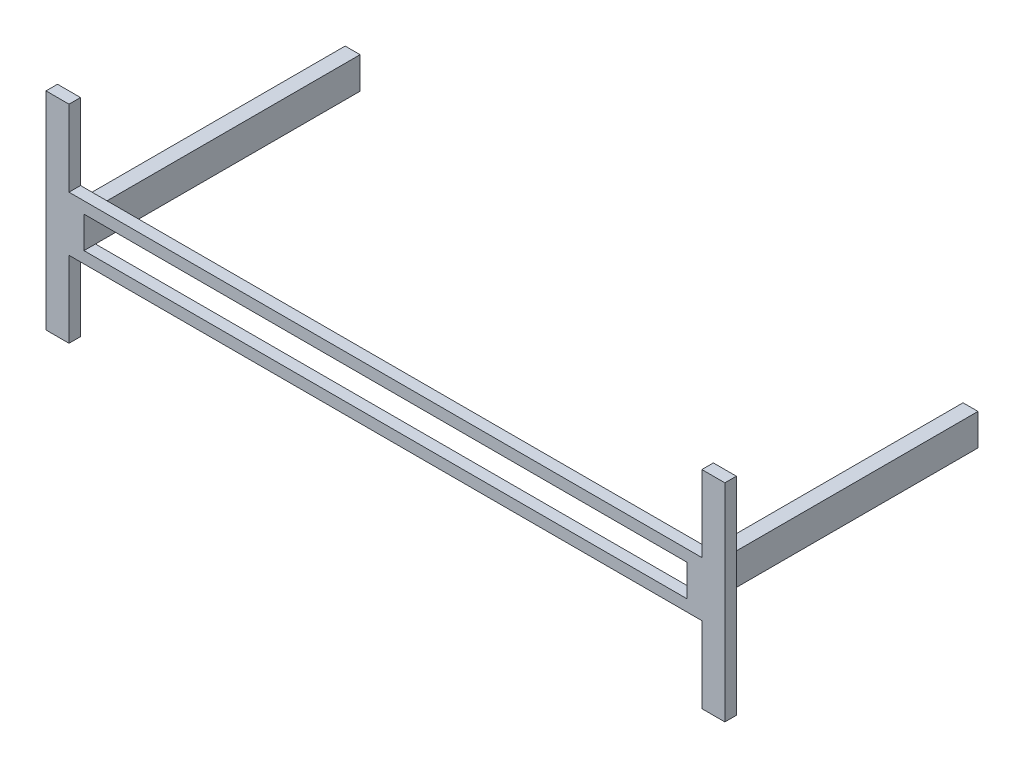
ISO-10303-21;
HEADER;
FILE_DESCRIPTION(('STEP AP214'),'2;1');
FILE_NAME('part.step','',(''),(''),'','','');
FILE_SCHEMA(('AUTOMOTIVE_DESIGN { 1 0 10303 214 1 1 1 1 }'));
ENDSEC;
DATA;
#1=APPLICATION_CONTEXT('core data for automotive mechanical design processes');
#2=APPLICATION_PROTOCOL_DEFINITION('international standard','automotive_design',2000,#1);
#3=PRODUCT_CONTEXT('',#1,'mechanical');
#4=PRODUCT('Part','Part','',(#3));
#5=PRODUCT_RELATED_PRODUCT_CATEGORY('part','',(#4));
#6=PRODUCT_DEFINITION_FORMATION('','',#4);
#7=PRODUCT_DEFINITION_CONTEXT('part definition',#1,'design');
#8=PRODUCT_DEFINITION('design','',#6,#7);
#9=PRODUCT_DEFINITION_SHAPE('','',#8);
#10=(LENGTH_UNIT() NAMED_UNIT(*) SI_UNIT(.MILLI.,.METRE.));
#11=(NAMED_UNIT(*) PLANE_ANGLE_UNIT() SI_UNIT($,.RADIAN.));
#12=(NAMED_UNIT(*) SI_UNIT($,.STERADIAN.) SOLID_ANGLE_UNIT());
#13=UNCERTAINTY_MEASURE_WITH_UNIT(LENGTH_MEASURE(1.E-05),#10,'distance_accuracy_value','');
#14=(GEOMETRIC_REPRESENTATION_CONTEXT(3) GLOBAL_UNCERTAINTY_ASSIGNED_CONTEXT((#13)) GLOBAL_UNIT_ASSIGNED_CONTEXT((#10,
#11,#12)) REPRESENTATION_CONTEXT('',''));
#15=CARTESIAN_POINT('',(0.,0.,0.));
#16=DIRECTION('',(0.,0.,1.));
#17=DIRECTION('',(1.,0.,0.));
#18=AXIS2_PLACEMENT_3D('',#15,#16,#17);
#19=CARTESIAN_POINT('',(0.,-34.9249999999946,-609.6));
#20=DIRECTION('',(0.,-1.,0.));
#21=DIRECTION('',(0.,0.,-1.));
#22=AXIS2_PLACEMENT_3D('',#19,#20,#21);
#23=PLANE('',#22);
#24=DIRECTION('',(0.,0.,1.));
#25=VECTOR('',#24,1.);
#26=CARTESIAN_POINT('',(-665.48,-34.9249999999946,-609.6));
#27=LINE('',#26,#25);
#28=CARTESIAN_POINT('',(-665.48,-34.9249999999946,-609.6));
#29=VERTEX_POINT('',#28);
#30=CARTESIAN_POINT('',(-665.48,-34.9249999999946,-25.4));
#31=VERTEX_POINT('',#30);
#32=EDGE_CURVE('E12',#29,#31,#27,.T.);
#33=ORIENTED_EDGE('',*,*,#32,.T.);
#34=DIRECTION('',(1.,0.,0.));
#35=VECTOR('',#34,1.);
#36=CARTESIAN_POINT('',(0.,-34.9249999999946,-25.4));
#37=LINE('',#36,#35);
#38=CARTESIAN_POINT('',(-698.5,-34.9249999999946,-25.4));
#39=VERTEX_POINT('',#38);
#40=EDGE_CURVE('E315',#39,#31,#37,.T.);
#41=ORIENTED_EDGE('',*,*,#40,.F.);
#42=DIRECTION('',(0.,0.,1.));
#43=VECTOR('',#42,1.);
#44=CARTESIAN_POINT('',(-698.499999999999,-34.9249999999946,-609.6));
#45=LINE('',#44,#43);
#46=CARTESIAN_POINT('',(-698.499999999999,-34.9249999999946,-609.6));
#47=VERTEX_POINT('',#46);
#48=EDGE_CURVE('E100',#47,#39,#45,.T.);
#49=ORIENTED_EDGE('',*,*,#48,.F.);
#50=DIRECTION('',(1.,0.,0.));
#51=VECTOR('',#50,1.);
#52=CARTESIAN_POINT('',(0.,-34.9249999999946,-609.6));
#53=LINE('',#52,#51);
#54=EDGE_CURVE('E450',#47,#29,#53,.T.);
#55=ORIENTED_EDGE('',*,*,#54,.T.);
#56=EDGE_LOOP('',(#33,#41,#49,#55));
#57=FACE_BOUND('',#56,.T.);
#58=ADVANCED_FACE('F89',(#57),#23,.T.);
#59=CARTESIAN_POINT('',(-698.5,-8.88178419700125E-12,-609.6));
#60=DIRECTION('',(-1.,0.,0.));
#61=DIRECTION('',(0.,-1.,0.));
#62=AXIS2_PLACEMENT_3D('',#59,#60,#61);
#63=PLANE('',#62);
#64=ORIENTED_EDGE('',*,*,#48,.T.);
#65=DIRECTION('',(0.,-1.,0.));
#66=VECTOR('',#65,1.);
#67=CARTESIAN_POINT('',(-698.5,0.,-25.4));
#68=LINE('',#67,#66);
#69=CARTESIAN_POINT('',(-698.5,34.9250000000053,-25.4));
#70=VERTEX_POINT('',#69);
#71=EDGE_CURVE('E310',#70,#39,#68,.T.);
#72=ORIENTED_EDGE('',*,*,#71,.F.);
#73=DIRECTION('',(0.,0.,1.));
#74=VECTOR('',#73,1.);
#75=CARTESIAN_POINT('',(-698.5,34.9250000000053,-609.6));
#76=LINE('',#75,#74);
#77=CARTESIAN_POINT('',(-698.5,34.9250000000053,-609.6));
#78=VERTEX_POINT('',#77);
#79=EDGE_CURVE('E459',#78,#70,#76,.T.);
#80=ORIENTED_EDGE('',*,*,#79,.F.);
#81=DIRECTION('',(0.,-1.,0.));
#82=VECTOR('',#81,1.);
#83=CARTESIAN_POINT('',(-698.5,-8.88178419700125E-12,-609.6));
#84=LINE('',#83,#82);
#85=EDGE_CURVE('E446',#78,#47,#84,.T.);
#86=ORIENTED_EDGE('',*,*,#85,.T.);
#87=EDGE_LOOP('',(#64,#72,#80,#86));
#88=FACE_BOUND('',#87,.T.);
#89=ADVANCED_FACE('F478',(#88),#63,.T.);
#90=CARTESIAN_POINT('',(0.,34.9250000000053,-609.6));
#91=DIRECTION('',(0.,-1.,0.));
#92=DIRECTION('',(0.,0.,-1.));
#93=AXIS2_PLACEMENT_3D('',#90,#91,#92);
#94=PLANE('',#93);
#95=DIRECTION('',(1.,0.,0.));
#96=VECTOR('',#95,1.);
#97=CARTESIAN_POINT('',(0.,34.9250000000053,-25.4));
#98=LINE('',#97,#96);
#99=CARTESIAN_POINT('',(-665.48,34.9250000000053,-25.4));
#100=VERTEX_POINT('',#99);
#101=EDGE_CURVE('E319',#70,#100,#98,.T.);
#102=ORIENTED_EDGE('',*,*,#101,.T.);
#103=DIRECTION('',(0.,0.,1.));
#104=VECTOR('',#103,1.);
#105=CARTESIAN_POINT('',(-665.48,34.9250000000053,-609.6));
#106=LINE('',#105,#104);
#107=CARTESIAN_POINT('',(-665.48,34.9250000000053,-609.6));
#108=VERTEX_POINT('',#107);
#109=EDGE_CURVE('E93',#108,#100,#106,.T.);
#110=ORIENTED_EDGE('',*,*,#109,.F.);
#111=DIRECTION('',(1.,0.,0.));
#112=VECTOR('',#111,1.);
#113=CARTESIAN_POINT('',(0.,34.9250000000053,-609.6));
#114=LINE('',#113,#112);
#115=EDGE_CURVE('E443',#78,#108,#114,.T.);
#116=ORIENTED_EDGE('',*,*,#115,.F.);
#117=ORIENTED_EDGE('',*,*,#79,.T.);
#118=EDGE_LOOP('',(#102,#110,#116,#117));
#119=FACE_BOUND('',#118,.T.);
#120=ADVANCED_FACE('F469',(#119),#94,.F.);
#121=CARTESIAN_POINT('',(-665.48,0.,-609.6));
#122=DIRECTION('',(-1.,0.,0.));
#123=DIRECTION('',(0.,0.,1.));
#124=AXIS2_PLACEMENT_3D('',#121,#122,#123);
#125=PLANE('',#124);
#126=DIRECTION('',(0.,-1.,0.));
#127=VECTOR('',#126,1.);
#128=CARTESIAN_POINT('',(-665.48,0.,0.));
#129=LINE('',#128,#127);
#130=CARTESIAN_POINT('',(-665.48,34.9250000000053,0.));
#131=VERTEX_POINT('',#130);
#132=CARTESIAN_POINT('',(-665.48,-34.9249999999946,0.));
#133=VERTEX_POINT('',#132);
#134=EDGE_CURVE('E440',#131,#133,#129,.T.);
#135=ORIENTED_EDGE('',*,*,#134,.T.);
#136=DIRECTION('',(0.,0.,1.));
#137=VECTOR('',#136,1.);
#138=CARTESIAN_POINT('',(-665.48,-34.9249999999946,-609.6));
#139=LINE('',#138,#137);
#140=EDGE_CURVE('E363',#31,#133,#139,.T.);
#141=ORIENTED_EDGE('',*,*,#140,.F.);
#142=ORIENTED_EDGE('',*,*,#32,.F.);
#143=DIRECTION('',(0.,-1.,0.));
#144=VECTOR('',#143,1.);
#145=CARTESIAN_POINT('',(-665.48,0.,-609.6));
#146=LINE('',#145,#144);
#147=EDGE_CURVE('E108',#108,#29,#146,.T.);
#148=ORIENTED_EDGE('',*,*,#147,.F.);
#149=ORIENTED_EDGE('',*,*,#109,.T.);
#150=DIRECTION('',(0.,0.,1.));
#151=VECTOR('',#150,1.);
#152=CARTESIAN_POINT('',(-665.48,34.9250000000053,-609.6));
#153=LINE('',#152,#151);
#154=EDGE_CURVE('E436',#100,#131,#153,.T.);
#155=ORIENTED_EDGE('',*,*,#154,.T.);
#156=EDGE_LOOP('',(#135,#141,#142,#148,#149,#155));
#157=FACE_BOUND('',#156,.T.);
#158=ADVANCED_FACE('F91',(#157),#125,.F.);
#159=CARTESIAN_POINT('',(0.,0.,-609.6));
#160=DIRECTION('',(0.,0.,1.));
#161=DIRECTION('',(1.,0.,0.));
#162=AXIS2_PLACEMENT_3D('',#159,#160,#161);
#163=PLANE('',#162);
#164=ORIENTED_EDGE('',*,*,#147,.T.);
#165=ORIENTED_EDGE('',*,*,#54,.F.);
#166=ORIENTED_EDGE('',*,*,#85,.F.);
#167=ORIENTED_EDGE('',*,*,#115,.T.);
#168=EDGE_LOOP('',(#164,#165,#166,#167));
#169=FACE_BOUND('',#168,.T.);
#170=ADVANCED_FACE('F551',(#169),#163,.F.);
#171=CARTESIAN_POINT('',(0.,0.,0.));
#172=DIRECTION('',(0.,0.,1.));
#173=DIRECTION('',(1.,0.,0.));
#174=AXIS2_PLACEMENT_3D('',#171,#172,#173);
#175=PLANE('',#174);
#176=ORIENTED_EDGE('',*,*,#134,.F.);
#177=DIRECTION('',(1.,0.,0.));
#178=VECTOR('',#177,1.);
#179=CARTESIAN_POINT('',(0.,34.9250000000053,0.));
#180=LINE('',#179,#178);
#181=CARTESIAN_POINT('',(665.48,34.9250000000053,0.));
#182=VERTEX_POINT('',#181);
#183=EDGE_CURVE('E352',#131,#182,#180,.T.);
#184=ORIENTED_EDGE('',*,*,#183,.T.);
#185=DIRECTION('',(0.,-1.,0.));
#186=VECTOR('',#185,1.);
#187=CARTESIAN_POINT('',(665.48,0.,0.));
#188=LINE('',#187,#186);
#189=CARTESIAN_POINT('',(665.48,-34.9249999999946,0.));
#190=VERTEX_POINT('',#189);
#191=EDGE_CURVE('E266',#182,#190,#188,.T.);
#192=ORIENTED_EDGE('',*,*,#191,.T.);
#193=DIRECTION('',(1.,0.,0.));
#194=VECTOR('',#193,1.);
#195=CARTESIAN_POINT('',(0.,-34.9249999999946,0.));
#196=LINE('',#195,#194);
#197=EDGE_CURVE('E348',#133,#190,#196,.T.);
#198=ORIENTED_EDGE('',*,*,#197,.F.);
#199=EDGE_LOOP('',(#176,#184,#192,#198));
#200=FACE_BOUND('',#199,.T.);
#201=DIRECTION('',(1.,0.,0.));
#202=VECTOR('',#201,1.);
#203=CARTESIAN_POINT('',(0.,-60.3249999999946,0.));
#204=LINE('',#203,#202);
#205=CARTESIAN_POINT('',(-698.5,-60.3249999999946,0.));
#206=VERTEX_POINT('',#205);
#207=CARTESIAN_POINT('',(698.5,-60.3249999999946,0.));
#208=VERTEX_POINT('',#207);
#209=EDGE_CURVE('E344',#206,#208,#204,.T.);
#210=ORIENTED_EDGE('',*,*,#209,.T.);
#211=DIRECTION('',(0.,-1.,0.));
#212=VECTOR('',#211,1.);
#213=CARTESIAN_POINT('',(698.5,228.6,0.));
#214=LINE('',#213,#212);
#215=CARTESIAN_POINT('',(698.5,-228.6,0.));
#216=VERTEX_POINT('',#215);
#217=EDGE_CURVE('E417',#208,#216,#214,.T.);
#218=ORIENTED_EDGE('',*,*,#217,.T.);
#219=DIRECTION('',(1.,0.,0.));
#220=VECTOR('',#219,1.);
#221=CARTESIAN_POINT('',(698.5,-228.6,0.));
#222=LINE('',#221,#220);
#223=CARTESIAN_POINT('',(749.3,-228.6,0.));
#224=VERTEX_POINT('',#223);
#225=EDGE_CURVE('E413',#216,#224,#222,.T.);
#226=ORIENTED_EDGE('',*,*,#225,.T.);
#227=DIRECTION('',(0.,-1.,0.));
#228=VECTOR('',#227,1.);
#229=CARTESIAN_POINT('',(749.3,228.6,0.));
#230=LINE('',#229,#228);
#231=CARTESIAN_POINT('',(749.3,228.6,0.));
#232=VERTEX_POINT('',#231);
#233=EDGE_CURVE('E409',#232,#224,#230,.T.);
#234=ORIENTED_EDGE('',*,*,#233,.F.);
#235=DIRECTION('',(1.,0.,0.));
#236=VECTOR('',#235,1.);
#237=CARTESIAN_POINT('',(698.5,228.6,0.));
#238=LINE('',#237,#236);
#239=CARTESIAN_POINT('',(698.5,228.6,0.));
#240=VERTEX_POINT('',#239);
#241=EDGE_CURVE('E292',#240,#232,#238,.T.);
#242=ORIENTED_EDGE('',*,*,#241,.F.);
#243=CARTESIAN_POINT('',(698.5,60.3250000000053,0.));
#244=VERTEX_POINT('',#243);
#245=EDGE_CURVE('E392',#240,#244,#214,.T.);
#246=ORIENTED_EDGE('',*,*,#245,.T.);
#247=DIRECTION('',(1.,0.,0.));
#248=VECTOR('',#247,1.);
#249=CARTESIAN_POINT('',(0.,60.3250000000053,0.));
#250=LINE('',#249,#248);
#251=CARTESIAN_POINT('',(-698.5,60.3250000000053,0.));
#252=VERTEX_POINT('',#251);
#253=EDGE_CURVE('E356',#252,#244,#250,.T.);
#254=ORIENTED_EDGE('',*,*,#253,.F.);
#255=DIRECTION('',(0.,-1.,0.));
#256=VECTOR('',#255,1.);
#257=CARTESIAN_POINT('',(-698.5,0.,0.));
#258=LINE('',#257,#256);
#259=CARTESIAN_POINT('',(-698.5,228.6,0.));
#260=VERTEX_POINT('',#259);
#261=EDGE_CURVE('E298',#260,#252,#258,.T.);
#262=ORIENTED_EDGE('',*,*,#261,.F.);
#263=DIRECTION('',(-1.,0.,0.));
#264=VECTOR('',#263,1.);
#265=CARTESIAN_POINT('',(-2.49800180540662E-13,228.600000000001,0.));
#266=LINE('',#265,#264);
#267=CARTESIAN_POINT('',(-749.3,228.6,0.));
#268=VERTEX_POINT('',#267);
#269=EDGE_CURVE('E328',#260,#268,#266,.T.);
#270=ORIENTED_EDGE('',*,*,#269,.T.);
#271=DIRECTION('',(0.,-1.,0.));
#272=VECTOR('',#271,1.);
#273=CARTESIAN_POINT('',(-749.3,1.81953217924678E-13,0.));
#274=LINE('',#273,#272);
#275=CARTESIAN_POINT('',(-749.3,-228.6,0.));
#276=VERTEX_POINT('',#275);
#277=EDGE_CURVE('E332',#268,#276,#274,.T.);
#278=ORIENTED_EDGE('',*,*,#277,.T.);
#279=DIRECTION('',(-1.,0.,0.));
#280=VECTOR('',#279,1.);
#281=CARTESIAN_POINT('',(-1.49880108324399E-12,-228.600000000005,0.));
#282=LINE('',#281,#280);
#283=CARTESIAN_POINT('',(-698.5,-228.6,0.));
#284=VERTEX_POINT('',#283);
#285=EDGE_CURVE('E337',#284,#276,#282,.T.);
#286=ORIENTED_EDGE('',*,*,#285,.F.);
#287=EDGE_CURVE('E341',#206,#284,#258,.T.);
#288=ORIENTED_EDGE('',*,*,#287,.F.);
#289=EDGE_LOOP('',(#210,#218,#226,#234,#242,#246,#254,#262,#270,#278,#286,#288));
#290=FACE_BOUND('',#289,.T.);
#291=ADVANCED_FACE('F536',(#200,#290),#175,.T.);
#292=CARTESIAN_POINT('',(0.,34.9250000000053,-25.4));
#293=DIRECTION('',(0.,-1.,0.));
#294=DIRECTION('',(0.,0.,-1.));
#295=AXIS2_PLACEMENT_3D('',#292,#293,#294);
#296=PLANE('',#295);
#297=DIRECTION('',(0.,0.,1.));
#298=VECTOR('',#297,1.);
#299=CARTESIAN_POINT('',(665.48,34.9250000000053,-609.6));
#300=LINE('',#299,#298);
#301=CARTESIAN_POINT('',(665.48,34.9250000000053,-25.4000000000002));
#302=VERTEX_POINT('',#301);
#303=EDGE_CURVE('E258',#302,#182,#300,.T.);
#304=ORIENTED_EDGE('',*,*,#303,.T.);
#305=ORIENTED_EDGE('',*,*,#183,.F.);
#306=ORIENTED_EDGE('',*,*,#154,.F.);
#307=EDGE_CURVE('E324',#100,#302,#98,.T.);
#308=ORIENTED_EDGE('',*,*,#307,.T.);
#309=EDGE_LOOP('',(#304,#305,#306,#308));
#310=FACE_BOUND('',#309,.T.);
#311=ADVANCED_FACE('F544',(#310),#296,.T.);
#312=CARTESIAN_POINT('',(0.,-34.9249999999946,-25.4));
#313=DIRECTION('',(0.,-1.,0.));
#314=DIRECTION('',(0.,0.,-1.));
#315=AXIS2_PLACEMENT_3D('',#312,#313,#314);
#316=PLANE('',#315);
#317=ORIENTED_EDGE('',*,*,#197,.T.);
#318=DIRECTION('',(0.,0.,1.));
#319=VECTOR('',#318,1.);
#320=CARTESIAN_POINT('',(665.48,-34.9249999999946,-609.6));
#321=LINE('',#320,#319);
#322=CARTESIAN_POINT('',(665.48,-34.9249999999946,-25.4000000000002));
#323=VERTEX_POINT('',#322);
#324=EDGE_CURVE('E282',#323,#190,#321,.T.);
#325=ORIENTED_EDGE('',*,*,#324,.F.);
#326=EDGE_CURVE('E314',#31,#323,#37,.T.);
#327=ORIENTED_EDGE('',*,*,#326,.F.);
#328=ORIENTED_EDGE('',*,*,#140,.T.);
#329=EDGE_LOOP('',(#317,#325,#327,#328));
#330=FACE_BOUND('',#329,.T.);
#331=ADVANCED_FACE('F593',(#330),#316,.F.);
#332=CARTESIAN_POINT('',(-698.5,0.,-25.4));
#333=DIRECTION('',(-1.,0.,0.));
#334=DIRECTION('',(0.,0.,1.));
#335=AXIS2_PLACEMENT_3D('',#332,#333,#334);
#336=PLANE('',#335);
#337=ORIENTED_EDGE('',*,*,#261,.T.);
#338=DIRECTION('',(0.,0.,1.));
#339=VECTOR('',#338,1.);
#340=CARTESIAN_POINT('',(-698.5,60.3250000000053,-25.4));
#341=LINE('',#340,#339);
#342=CARTESIAN_POINT('',(-698.5,60.3250000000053,-25.4));
#343=VERTEX_POINT('',#342);
#344=EDGE_CURVE('E364',#343,#252,#341,.T.);
#345=ORIENTED_EDGE('',*,*,#344,.F.);
#346=CARTESIAN_POINT('',(-698.5,228.6,-25.4));
#347=VERTEX_POINT('',#346);
#348=EDGE_CURVE('E309',#347,#343,#68,.T.);
#349=ORIENTED_EDGE('',*,*,#348,.F.);
#350=DIRECTION('',(0.,0.,1.));
#351=VECTOR('',#350,1.);
#352=CARTESIAN_POINT('',(-698.5,228.6,-25.4));
#353=LINE('',#352,#351);
#354=EDGE_CURVE('E360',#347,#260,#353,.T.);
#355=ORIENTED_EDGE('',*,*,#354,.T.);
#356=EDGE_LOOP('',(#337,#345,#349,#355));
#357=FACE_BOUND('',#356,.T.);
#358=ADVANCED_FACE('F491',(#357),#336,.F.);
#359=CARTESIAN_POINT('',(0.,60.3250000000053,-25.4));
#360=DIRECTION('',(0.,-1.,0.));
#361=DIRECTION('',(0.,0.,-1.));
#362=AXIS2_PLACEMENT_3D('',#359,#360,#361);
#363=PLANE('',#362);
#364=ORIENTED_EDGE('',*,*,#253,.T.);
#365=DIRECTION('',(0.,0.,1.));
#366=VECTOR('',#365,1.);
#367=CARTESIAN_POINT('',(698.5,60.3250000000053,-25.4));
#368=LINE('',#367,#366);
#369=CARTESIAN_POINT('',(698.5,60.3250000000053,-25.4));
#370=VERTEX_POINT('',#369);
#371=EDGE_CURVE('E368',#370,#244,#368,.T.);
#372=ORIENTED_EDGE('',*,*,#371,.F.);
#373=DIRECTION('',(1.,0.,0.));
#374=VECTOR('',#373,1.);
#375=CARTESIAN_POINT('',(0.,60.3250000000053,-25.4));
#376=LINE('',#375,#374);
#377=EDGE_CURVE('E323',#343,#370,#376,.T.);
#378=ORIENTED_EDGE('',*,*,#377,.F.);
#379=ORIENTED_EDGE('',*,*,#344,.T.);
#380=EDGE_LOOP('',(#364,#372,#378,#379));
#381=FACE_BOUND('',#380,.T.);
#382=ADVANCED_FACE('F495',(#381),#363,.F.);
#383=CARTESIAN_POINT('',(0.,-60.3249999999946,-25.4));
#384=DIRECTION('',(0.,-1.,0.));
#385=DIRECTION('',(0.,0.,-1.));
#386=AXIS2_PLACEMENT_3D('',#383,#384,#385);
#387=PLANE('',#386);
#388=ORIENTED_EDGE('',*,*,#209,.F.);
#389=DIRECTION('',(0.,0.,1.));
#390=VECTOR('',#389,1.);
#391=CARTESIAN_POINT('',(-698.5,-60.3249999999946,-25.4));
#392=LINE('',#391,#390);
#393=CARTESIAN_POINT('',(-698.5,-60.3249999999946,-25.4));
#394=VERTEX_POINT('',#393);
#395=EDGE_CURVE('E374',#394,#206,#392,.T.);
#396=ORIENTED_EDGE('',*,*,#395,.F.);
#397=DIRECTION('',(1.,0.,0.));
#398=VECTOR('',#397,1.);
#399=CARTESIAN_POINT('',(0.,-60.3249999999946,-25.4));
#400=LINE('',#399,#398);
#401=CARTESIAN_POINT('',(698.5,-60.3249999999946,-25.4));
#402=VERTEX_POINT('',#401);
#403=EDGE_CURVE('E308',#394,#402,#400,.T.);
#404=ORIENTED_EDGE('',*,*,#403,.T.);
#405=DIRECTION('',(0.,0.,1.));
#406=VECTOR('',#405,1.);
#407=CARTESIAN_POINT('',(698.5,-60.3249999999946,-25.4));
#408=LINE('',#407,#406);
#409=EDGE_CURVE('E371',#402,#208,#408,.T.);
#410=ORIENTED_EDGE('',*,*,#409,.T.);
#411=EDGE_LOOP('',(#388,#396,#404,#410));
#412=FACE_BOUND('',#411,.T.);
#413=ADVANCED_FACE('F517',(#412),#387,.T.);
#414=ORIENTED_EDGE('',*,*,#287,.T.);
#415=DIRECTION('',(0.,0.,1.));
#416=VECTOR('',#415,1.);
#417=CARTESIAN_POINT('',(-698.5,-228.6,-25.4));
#418=LINE('',#417,#416);
#419=CARTESIAN_POINT('',(-698.5,-228.6,-25.4));
#420=VERTEX_POINT('',#419);
#421=EDGE_CURVE('E377',#420,#284,#418,.T.);
#422=ORIENTED_EDGE('',*,*,#421,.F.);
#423=EDGE_CURVE('E305',#394,#420,#68,.T.);
#424=ORIENTED_EDGE('',*,*,#423,.F.);
#425=ORIENTED_EDGE('',*,*,#395,.T.);
#426=EDGE_LOOP('',(#414,#422,#424,#425));
#427=FACE_BOUND('',#426,.T.);
#428=ADVANCED_FACE('F523',(#427),#336,.F.);
#429=CARTESIAN_POINT('',(-1.49880108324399E-12,-228.600000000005,-25.4));
#430=DIRECTION('',(0.,1.,0.));
#431=DIRECTION('',(-1.,0.,0.));
#432=AXIS2_PLACEMENT_3D('',#429,#430,#431);
#433=PLANE('',#432);
#434=ORIENTED_EDGE('',*,*,#285,.T.);
#435=DIRECTION('',(0.,0.,1.));
#436=VECTOR('',#435,1.);
#437=CARTESIAN_POINT('',(-749.3,-228.6,-25.4));
#438=LINE('',#437,#436);
#439=CARTESIAN_POINT('',(-749.3,-228.6,-25.4));
#440=VERTEX_POINT('',#439);
#441=EDGE_CURVE('E381',#440,#276,#438,.T.);
#442=ORIENTED_EDGE('',*,*,#441,.F.);
#443=DIRECTION('',(-1.,0.,0.));
#444=VECTOR('',#443,1.);
#445=CARTESIAN_POINT('',(-1.49880108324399E-12,-228.600000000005,-25.4));
#446=LINE('',#445,#444);
#447=EDGE_CURVE('E302',#420,#440,#446,.T.);
#448=ORIENTED_EDGE('',*,*,#447,.F.);
#449=ORIENTED_EDGE('',*,*,#421,.T.);
#450=EDGE_LOOP('',(#434,#442,#448,#449));
#451=FACE_BOUND('',#450,.T.);
#452=ADVANCED_FACE('F527',(#451),#433,.F.);
#453=CARTESIAN_POINT('',(-749.3,1.81953217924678E-13,-25.4));
#454=DIRECTION('',(-1.,0.,0.));
#455=DIRECTION('',(0.,-1.,0.));
#456=AXIS2_PLACEMENT_3D('',#453,#454,#455);
#457=PLANE('',#456);
#458=ORIENTED_EDGE('',*,*,#277,.F.);
#459=DIRECTION('',(0.,0.,1.));
#460=VECTOR('',#459,1.);
#461=CARTESIAN_POINT('',(-749.3,228.6,-25.4));
#462=LINE('',#461,#460);
#463=CARTESIAN_POINT('',(-749.3,228.6,-25.4));
#464=VERTEX_POINT('',#463);
#465=EDGE_CURVE('E384',#464,#268,#462,.T.);
#466=ORIENTED_EDGE('',*,*,#465,.F.);
#467=DIRECTION('',(0.,-1.,0.));
#468=VECTOR('',#467,1.);
#469=CARTESIAN_POINT('',(-749.3,1.81953217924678E-13,-25.4));
#470=LINE('',#469,#468);
#471=EDGE_CURVE('E297',#464,#440,#470,.T.);
#472=ORIENTED_EDGE('',*,*,#471,.T.);
#473=ORIENTED_EDGE('',*,*,#441,.T.);
#474=EDGE_LOOP('',(#458,#466,#472,#473));
#475=FACE_BOUND('',#474,.T.);
#476=ADVANCED_FACE('F531',(#475),#457,.T.);
#477=CARTESIAN_POINT('',(-2.49800180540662E-13,228.600000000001,-25.4));
#478=DIRECTION('',(0.,1.,0.));
#479=DIRECTION('',(-1.,0.,0.));
#480=AXIS2_PLACEMENT_3D('',#477,#478,#479);
#481=PLANE('',#480);
#482=ORIENTED_EDGE('',*,*,#269,.F.);
#483=ORIENTED_EDGE('',*,*,#354,.F.);
#484=DIRECTION('',(-1.,0.,0.));
#485=VECTOR('',#484,1.);
#486=CARTESIAN_POINT('',(-2.49800180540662E-13,228.600000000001,-25.4));
#487=LINE('',#486,#485);
#488=EDGE_CURVE('E293',#347,#464,#487,.T.);
#489=ORIENTED_EDGE('',*,*,#488,.T.);
#490=ORIENTED_EDGE('',*,*,#465,.T.);
#491=EDGE_LOOP('',(#482,#483,#489,#490));
#492=FACE_BOUND('',#491,.T.);
#493=ADVANCED_FACE('F534',(#492),#481,.T.);
#494=CARTESIAN_POINT('',(0.,0.,-25.4));
#495=DIRECTION('',(0.,0.,1.));
#496=DIRECTION('',(1.,0.,0.));
#497=AXIS2_PLACEMENT_3D('',#494,#495,#496);
#498=PLANE('',#497);
#499=DIRECTION('',(0.,-1.,0.));
#500=VECTOR('',#499,1.);
#501=CARTESIAN_POINT('',(698.5,228.6,-25.4));
#502=LINE('',#501,#500);
#503=CARTESIAN_POINT('',(698.5,-228.6,-25.4));
#504=VERTEX_POINT('',#503);
#505=EDGE_CURVE('E399',#402,#504,#502,.T.);
#506=ORIENTED_EDGE('',*,*,#505,.F.);
#507=ORIENTED_EDGE('',*,*,#403,.F.);
#508=ORIENTED_EDGE('',*,*,#423,.T.);
#509=ORIENTED_EDGE('',*,*,#447,.T.);
#510=ORIENTED_EDGE('',*,*,#471,.F.);
#511=ORIENTED_EDGE('',*,*,#488,.F.);
#512=ORIENTED_EDGE('',*,*,#348,.T.);
#513=ORIENTED_EDGE('',*,*,#377,.T.);
#514=CARTESIAN_POINT('',(698.5,228.6,-25.4));
#515=VERTEX_POINT('',#514);
#516=EDGE_CURVE('E400',#515,#370,#502,.T.);
#517=ORIENTED_EDGE('',*,*,#516,.F.);
#518=DIRECTION('',(1.,0.,0.));
#519=VECTOR('',#518,1.);
#520=CARTESIAN_POINT('',(698.5,228.6,-25.4));
#521=LINE('',#520,#519);
#522=CARTESIAN_POINT('',(749.3,228.6,-25.4));
#523=VERTEX_POINT('',#522);
#524=EDGE_CURVE('E387',#515,#523,#521,.T.);
#525=ORIENTED_EDGE('',*,*,#524,.T.);
#526=DIRECTION('',(0.,-1.,0.));
#527=VECTOR('',#526,1.);
#528=CARTESIAN_POINT('',(749.3,228.6,-25.4));
#529=LINE('',#528,#527);
#530=CARTESIAN_POINT('',(749.3,-228.6,-25.4));
#531=VERTEX_POINT('',#530);
#532=EDGE_CURVE('E391',#523,#531,#529,.T.);
#533=ORIENTED_EDGE('',*,*,#532,.T.);
#534=DIRECTION('',(1.,0.,0.));
#535=VECTOR('',#534,1.);
#536=CARTESIAN_POINT('',(698.5,-228.6,-25.4));
#537=LINE('',#536,#535);
#538=EDGE_CURVE('E395',#504,#531,#537,.T.);
#539=ORIENTED_EDGE('',*,*,#538,.F.);
#540=EDGE_LOOP('',(#506,#507,#508,#509,#510,#511,#512,#513,#517,#525,#533,#539));
#541=FACE_BOUND('',#540,.T.);
#542=ORIENTED_EDGE('',*,*,#40,.T.);
#543=ORIENTED_EDGE('',*,*,#326,.T.);
#544=DIRECTION('',(1.,0.,0.));
#545=VECTOR('',#544,1.);
#546=CARTESIAN_POINT('',(0.,-34.9249999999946,-25.4));
#547=LINE('',#546,#545);
#548=CARTESIAN_POINT('',(698.499999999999,-34.9249999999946,-25.4000000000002));
#549=VERTEX_POINT('',#548);
#550=EDGE_CURVE('E288',#323,#549,#547,.T.);
#551=ORIENTED_EDGE('',*,*,#550,.T.);
#552=CARTESIAN_POINT('',(698.5,34.9250000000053,-25.4000000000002));
#553=VERTEX_POINT('',#552);
#554=EDGE_CURVE('E405',#553,#549,#502,.T.);
#555=ORIENTED_EDGE('',*,*,#554,.F.);
#556=DIRECTION('',(1.,0.,0.));
#557=VECTOR('',#556,1.);
#558=CARTESIAN_POINT('',(0.,34.9250000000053,-25.4));
#559=LINE('',#558,#557);
#560=EDGE_CURVE('E254',#302,#553,#559,.T.);
#561=ORIENTED_EDGE('',*,*,#560,.F.);
#562=ORIENTED_EDGE('',*,*,#307,.F.);
#563=ORIENTED_EDGE('',*,*,#101,.F.);
#564=ORIENTED_EDGE('',*,*,#71,.T.);
#565=EDGE_LOOP('',(#542,#543,#551,#555,#561,#562,#563,#564));
#566=FACE_BOUND('',#565,.T.);
#567=ADVANCED_FACE('F474',(#541,#566),#498,.F.);
#568=CARTESIAN_POINT('',(749.3,228.6,-25.4));
#569=DIRECTION('',(-1.,0.,0.));
#570=DIRECTION('',(0.,-1.,0.));
#571=AXIS2_PLACEMENT_3D('',#568,#569,#570);
#572=PLANE('',#571);
#573=ORIENTED_EDGE('',*,*,#233,.T.);
#574=DIRECTION('',(0.,0.,1.));
#575=VECTOR('',#574,1.);
#576=CARTESIAN_POINT('',(749.3,-228.6,-25.4));
#577=LINE('',#576,#575);
#578=EDGE_CURVE('E427',#531,#224,#577,.T.);
#579=ORIENTED_EDGE('',*,*,#578,.F.);
#580=ORIENTED_EDGE('',*,*,#532,.F.);
#581=DIRECTION('',(0.,0.,1.));
#582=VECTOR('',#581,1.);
#583=CARTESIAN_POINT('',(749.3,228.6,-25.4));
#584=LINE('',#583,#582);
#585=EDGE_CURVE('E333',#523,#232,#584,.T.);
#586=ORIENTED_EDGE('',*,*,#585,.T.);
#587=EDGE_LOOP('',(#573,#579,#580,#586));
#588=FACE_BOUND('',#587,.T.);
#589=ADVANCED_FACE('F507',(#588),#572,.F.);
#590=CARTESIAN_POINT('',(698.5,-228.6,-25.4));
#591=DIRECTION('',(0.,-1.,0.));
#592=DIRECTION('',(1.,0.,0.));
#593=AXIS2_PLACEMENT_3D('',#590,#591,#592);
#594=PLANE('',#593);
#595=ORIENTED_EDGE('',*,*,#225,.F.);
#596=DIRECTION('',(0.,0.,1.));
#597=VECTOR('',#596,1.);
#598=CARTESIAN_POINT('',(698.5,-228.6,-25.4));
#599=LINE('',#598,#597);
#600=EDGE_CURVE('E423',#504,#216,#599,.T.);
#601=ORIENTED_EDGE('',*,*,#600,.F.);
#602=ORIENTED_EDGE('',*,*,#538,.T.);
#603=ORIENTED_EDGE('',*,*,#578,.T.);
#604=EDGE_LOOP('',(#595,#601,#602,#603));
#605=FACE_BOUND('',#604,.T.);
#606=ADVANCED_FACE('F511',(#605),#594,.T.);
#607=CARTESIAN_POINT('',(698.5,228.6,-25.4));
#608=DIRECTION('',(-1.,0.,0.));
#609=DIRECTION('',(0.,0.,1.));
#610=AXIS2_PLACEMENT_3D('',#607,#608,#609);
#611=PLANE('',#610);
#612=ORIENTED_EDGE('',*,*,#217,.F.);
#613=ORIENTED_EDGE('',*,*,#409,.F.);
#614=ORIENTED_EDGE('',*,*,#505,.T.);
#615=ORIENTED_EDGE('',*,*,#600,.T.);
#616=EDGE_LOOP('',(#612,#613,#614,#615));
#617=FACE_BOUND('',#616,.T.);
#618=ADVANCED_FACE('F615',(#617),#611,.T.);
#619=ORIENTED_EDGE('',*,*,#371,.T.);
#620=ORIENTED_EDGE('',*,*,#245,.F.);
#621=DIRECTION('',(0.,0.,1.));
#622=VECTOR('',#621,1.);
#623=CARTESIAN_POINT('',(698.5,228.6,-25.4));
#624=LINE('',#623,#622);
#625=EDGE_CURVE('E404',#515,#240,#624,.T.);
#626=ORIENTED_EDGE('',*,*,#625,.F.);
#627=ORIENTED_EDGE('',*,*,#516,.T.);
#628=EDGE_LOOP('',(#619,#620,#626,#627));
#629=FACE_BOUND('',#628,.T.);
#630=ADVANCED_FACE('F498',(#629),#611,.T.);
#631=CARTESIAN_POINT('',(698.5,228.6,-25.4));
#632=DIRECTION('',(0.,-1.,0.));
#633=DIRECTION('',(1.,0.,0.));
#634=AXIS2_PLACEMENT_3D('',#631,#632,#633);
#635=PLANE('',#634);
#636=ORIENTED_EDGE('',*,*,#241,.T.);
#637=ORIENTED_EDGE('',*,*,#585,.F.);
#638=ORIENTED_EDGE('',*,*,#524,.F.);
#639=ORIENTED_EDGE('',*,*,#625,.T.);
#640=EDGE_LOOP('',(#636,#637,#638,#639));
#641=FACE_BOUND('',#640,.T.);
#642=ADVANCED_FACE('F504',(#641),#635,.F.);
#643=CARTESIAN_POINT('',(698.5,-8.88178419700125E-12,-609.6));
#644=DIRECTION('',(-1.,0.,0.));
#645=DIRECTION('',(0.,-1.,0.));
#646=AXIS2_PLACEMENT_3D('',#643,#644,#645);
#647=PLANE('',#646);
#648=DIRECTION('',(0.,0.,1.));
#649=VECTOR('',#648,1.);
#650=CARTESIAN_POINT('',(698.5,34.9250000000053,-609.6));
#651=LINE('',#650,#649);
#652=CARTESIAN_POINT('',(698.5,34.9250000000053,-609.6));
#653=VERTEX_POINT('',#652);
#654=EDGE_CURVE('E251',#653,#553,#651,.T.);
#655=ORIENTED_EDGE('',*,*,#654,.T.);
#656=ORIENTED_EDGE('',*,*,#554,.T.);
#657=DIRECTION('',(0.,0.,1.));
#658=VECTOR('',#657,1.);
#659=CARTESIAN_POINT('',(698.499999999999,-34.9249999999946,-609.6));
#660=LINE('',#659,#658);
#661=CARTESIAN_POINT('',(698.499999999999,-34.9249999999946,-609.6));
#662=VERTEX_POINT('',#661);
#663=EDGE_CURVE('E263',#662,#549,#660,.T.);
#664=ORIENTED_EDGE('',*,*,#663,.F.);
#665=DIRECTION('',(0.,-1.,0.));
#666=VECTOR('',#665,1.);
#667=CARTESIAN_POINT('',(698.5,-8.88178419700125E-12,-609.6));
#668=LINE('',#667,#666);
#669=EDGE_CURVE('E242',#653,#662,#668,.T.);
#670=ORIENTED_EDGE('',*,*,#669,.F.);
#671=EDGE_LOOP('',(#655,#656,#664,#670));
#672=FACE_BOUND('',#671,.T.);
#673=ADVANCED_FACE('F261',(#672),#647,.F.);
#674=CARTESIAN_POINT('',(0.,-34.9249999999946,-609.6));
#675=DIRECTION('',(0.,-1.,0.));
#676=DIRECTION('',(0.,0.,-1.));
#677=AXIS2_PLACEMENT_3D('',#674,#675,#676);
#678=PLANE('',#677);
#679=ORIENTED_EDGE('',*,*,#550,.F.);
#680=CARTESIAN_POINT('',(665.48,-34.9249999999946,-609.6));
#681=VERTEX_POINT('',#680);
#682=EDGE_CURVE('E278',#681,#323,#321,.T.);
#683=ORIENTED_EDGE('',*,*,#682,.F.);
#684=DIRECTION('',(1.,0.,0.));
#685=VECTOR('',#684,1.);
#686=CARTESIAN_POINT('',(0.,-34.9249999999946,-609.6));
#687=LINE('',#686,#685);
#688=EDGE_CURVE('E259',#681,#662,#687,.T.);
#689=ORIENTED_EDGE('',*,*,#688,.T.);
#690=ORIENTED_EDGE('',*,*,#663,.T.);
#691=EDGE_LOOP('',(#679,#683,#689,#690));
#692=FACE_BOUND('',#691,.T.);
#693=ADVANCED_FACE('F721',(#692),#678,.T.);
#694=CARTESIAN_POINT('',(0.,34.9250000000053,-609.6));
#695=DIRECTION('',(0.,-1.,0.));
#696=DIRECTION('',(0.,0.,-1.));
#697=AXIS2_PLACEMENT_3D('',#694,#695,#696);
#698=PLANE('',#697);
#699=CARTESIAN_POINT('',(665.48,34.9250000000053,-609.6));
#700=VERTEX_POINT('',#699);
#701=EDGE_CURVE('E283',#700,#302,#300,.T.);
#702=ORIENTED_EDGE('',*,*,#701,.T.);
#703=ORIENTED_EDGE('',*,*,#560,.T.);
#704=ORIENTED_EDGE('',*,*,#654,.F.);
#705=DIRECTION('',(1.,0.,0.));
#706=VECTOR('',#705,1.);
#707=CARTESIAN_POINT('',(0.,34.9250000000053,-609.6));
#708=LINE('',#707,#706);
#709=EDGE_CURVE('E237',#700,#653,#708,.T.);
#710=ORIENTED_EDGE('',*,*,#709,.F.);
#711=EDGE_LOOP('',(#702,#703,#704,#710));
#712=FACE_BOUND('',#711,.T.);
#713=ADVANCED_FACE('F252',(#712),#698,.F.);
#714=CARTESIAN_POINT('',(665.48,0.,-609.6));
#715=DIRECTION('',(-1.,0.,0.));
#716=DIRECTION('',(0.,0.,1.));
#717=AXIS2_PLACEMENT_3D('',#714,#715,#716);
#718=PLANE('',#717);
#719=ORIENTED_EDGE('',*,*,#191,.F.);
#720=ORIENTED_EDGE('',*,*,#303,.F.);
#721=ORIENTED_EDGE('',*,*,#701,.F.);
#722=DIRECTION('',(0.,-1.,0.));
#723=VECTOR('',#722,1.);
#724=CARTESIAN_POINT('',(665.48,0.,-609.6));
#725=LINE('',#724,#723);
#726=EDGE_CURVE('E245',#700,#681,#725,.T.);
#727=ORIENTED_EDGE('',*,*,#726,.T.);
#728=ORIENTED_EDGE('',*,*,#682,.T.);
#729=ORIENTED_EDGE('',*,*,#324,.T.);
#730=EDGE_LOOP('',(#719,#720,#721,#727,#728,#729));
#731=FACE_BOUND('',#730,.T.);
#732=ADVANCED_FACE('F742',(#731),#718,.T.);
#733=CARTESIAN_POINT('',(0.,0.,-609.6));
#734=DIRECTION('',(0.,0.,1.));
#735=DIRECTION('',(1.,0.,0.));
#736=AXIS2_PLACEMENT_3D('',#733,#734,#735);
#737=PLANE('',#736);
#738=ORIENTED_EDGE('',*,*,#669,.T.);
#739=ORIENTED_EDGE('',*,*,#688,.F.);
#740=ORIENTED_EDGE('',*,*,#726,.F.);
#741=ORIENTED_EDGE('',*,*,#709,.T.);
#742=EDGE_LOOP('',(#738,#739,#740,#741));
#743=FACE_BOUND('',#742,.T.);
#744=ADVANCED_FACE('F239',(#743),#737,.F.);
#745=CLOSED_SHELL('',(#58,#89,#120,#158,#170,#291,#311,#331,#358,#382,#413,#428,#452,#476,#493,
#567,#589,#606,#618,#630,#642,#673,#693,#713,#732,#744));
#746=MANIFOLD_SOLID_BREP('B2',#745);
#747=ADVANCED_BREP_SHAPE_REPRESENTATION('',(#18,#746),#14);
#748=SHAPE_DEFINITION_REPRESENTATION(#9,#747);
ENDSEC;
END-ISO-10303-21;
